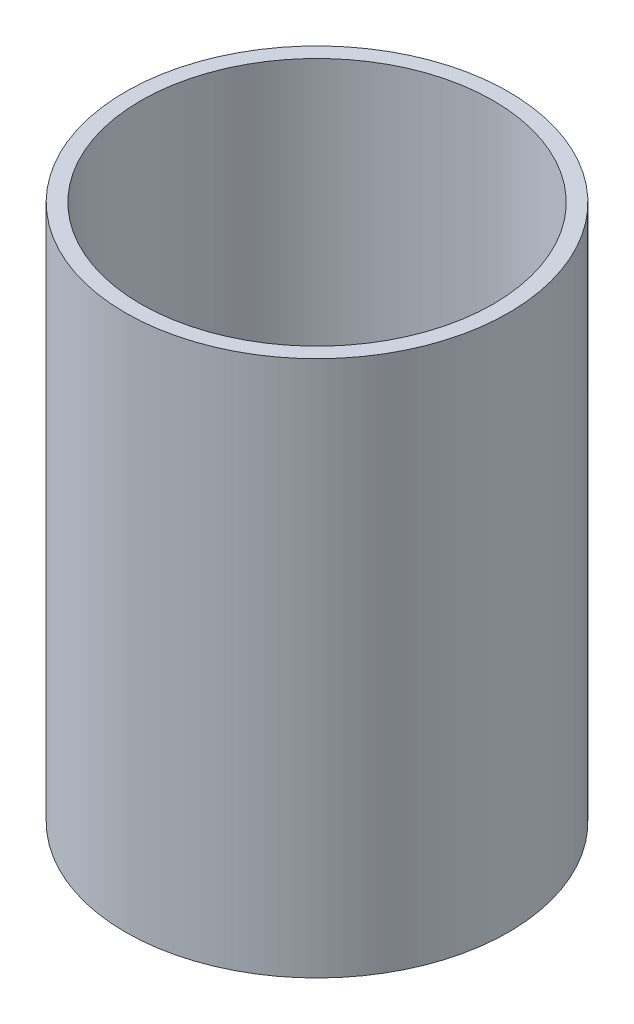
ISO-10303-21;
HEADER;
FILE_DESCRIPTION(('STEP AP214'),'2;1');
FILE_NAME('part.step','',(''),(''),'','','');
FILE_SCHEMA(('AUTOMOTIVE_DESIGN { 1 0 10303 214 1 1 1 1 }'));
ENDSEC;
DATA;
#1=APPLICATION_CONTEXT('core data for automotive mechanical design processes');
#2=APPLICATION_PROTOCOL_DEFINITION('international standard','automotive_design',2000,#1);
#3=PRODUCT_CONTEXT('',#1,'mechanical');
#4=PRODUCT('Part','Part','',(#3));
#5=PRODUCT_RELATED_PRODUCT_CATEGORY('part','',(#4));
#6=PRODUCT_DEFINITION_FORMATION('','',#4);
#7=PRODUCT_DEFINITION_CONTEXT('part definition',#1,'design');
#8=PRODUCT_DEFINITION('design','',#6,#7);
#9=PRODUCT_DEFINITION_SHAPE('','',#8);
#10=(LENGTH_UNIT() NAMED_UNIT(*) SI_UNIT(.MILLI.,.METRE.));
#11=(NAMED_UNIT(*) PLANE_ANGLE_UNIT() SI_UNIT($,.RADIAN.));
#12=(NAMED_UNIT(*) SI_UNIT($,.STERADIAN.) SOLID_ANGLE_UNIT());
#13=UNCERTAINTY_MEASURE_WITH_UNIT(LENGTH_MEASURE(1.E-05),#10,'distance_accuracy_value','');
#14=(GEOMETRIC_REPRESENTATION_CONTEXT(3) GLOBAL_UNCERTAINTY_ASSIGNED_CONTEXT((#13)) GLOBAL_UNIT_ASSIGNED_CONTEXT((#10,
#11,#12)) REPRESENTATION_CONTEXT('',''));
#15=CARTESIAN_POINT('',(0.,0.,0.));
#16=DIRECTION('',(0.,0.,1.));
#17=DIRECTION('',(1.,0.,0.));
#18=AXIS2_PLACEMENT_3D('',#15,#16,#17);
#19=CARTESIAN_POINT('',(0.,35.,0.));
#20=DIRECTION('',(0.,1.,0.));
#21=DIRECTION('',(0.,0.,1.));
#22=AXIS2_PLACEMENT_3D('',#19,#20,#21);
#23=PLANE('',#22);
#24=CARTESIAN_POINT('',(0.,35.,0.));
#25=DIRECTION('',(0.,1.,0.));
#26=DIRECTION('',(0.,0.,1.));
#27=AXIS2_PLACEMENT_3D('',#24,#25,#26);
#28=CIRCLE('',#27,12.5);
#29=CARTESIAN_POINT('',(0.,35.,12.5));
#30=VERTEX_POINT('',#29);
#31=EDGE_CURVE('E10',#30,#30,#28,.T.);
#32=ORIENTED_EDGE('',*,*,#31,.T.);
#33=EDGE_LOOP('',(#32));
#34=FACE_BOUND('',#33,.T.);
#35=CARTESIAN_POINT('',(0.,35.,0.));
#36=DIRECTION('',(0.,1.,0.));
#37=DIRECTION('',(0.,0.,1.));
#38=AXIS2_PLACEMENT_3D('',#35,#36,#37);
#39=CIRCLE('',#38,11.5);
#40=CARTESIAN_POINT('',(0.,35.,11.5));
#41=VERTEX_POINT('',#40);
#42=EDGE_CURVE('E40',#41,#41,#39,.T.);
#43=ORIENTED_EDGE('',*,*,#42,.F.);
#44=EDGE_LOOP('',(#43));
#45=FACE_BOUND('',#44,.T.);
#46=ADVANCED_FACE('F29',(#34,#45),#23,.T.);
#47=CARTESIAN_POINT('',(0.,0.,0.));
#48=DIRECTION('',(0.,1.,0.));
#49=DIRECTION('',(0.,0.,1.));
#50=AXIS2_PLACEMENT_3D('',#47,#48,#49);
#51=PLANE('',#50);
#52=CARTESIAN_POINT('',(0.,0.,0.));
#53=DIRECTION('',(0.,1.,0.));
#54=DIRECTION('',(0.,0.,1.));
#55=AXIS2_PLACEMENT_3D('',#52,#53,#54);
#56=CIRCLE('',#55,12.5);
#57=CARTESIAN_POINT('',(0.,0.,12.5));
#58=VERTEX_POINT('',#57);
#59=EDGE_CURVE('E33',#58,#58,#56,.T.);
#60=ORIENTED_EDGE('',*,*,#59,.F.);
#61=EDGE_LOOP('',(#60));
#62=FACE_BOUND('',#61,.T.);
#63=CARTESIAN_POINT('',(0.,0.,0.));
#64=DIRECTION('',(0.,1.,0.));
#65=DIRECTION('',(0.,0.,1.));
#66=AXIS2_PLACEMENT_3D('',#63,#64,#65);
#67=CIRCLE('',#66,11.5);
#68=CARTESIAN_POINT('',(0.,0.,11.5));
#69=VERTEX_POINT('',#68);
#70=EDGE_CURVE('E42',#69,#69,#67,.T.);
#71=ORIENTED_EDGE('',*,*,#70,.T.);
#72=EDGE_LOOP('',(#71));
#73=FACE_BOUND('',#72,.T.);
#74=ADVANCED_FACE('F52',(#62,#73),#51,.F.);
#75=CARTESIAN_POINT('',(0.,35.,0.));
#76=DIRECTION('',(0.,-1.,0.));
#77=DIRECTION('',(0.,0.,-1.));
#78=AXIS2_PLACEMENT_3D('',#75,#76,#77);
#79=CYLINDRICAL_SURFACE('',#78,12.5);
#80=ORIENTED_EDGE('',*,*,#31,.F.);
#81=EDGE_LOOP('',(#80));
#82=FACE_BOUND('',#81,.T.);
#83=ORIENTED_EDGE('',*,*,#59,.T.);
#84=EDGE_LOOP('',(#83));
#85=FACE_BOUND('',#84,.T.);
#86=ADVANCED_FACE('F31',(#82,#85),#79,.T.);
#87=CARTESIAN_POINT('',(0.,35.,0.));
#88=DIRECTION('',(0.,-1.,0.));
#89=DIRECTION('',(0.,0.,-1.));
#90=AXIS2_PLACEMENT_3D('',#87,#88,#89);
#91=CYLINDRICAL_SURFACE('',#90,11.5);
#92=ORIENTED_EDGE('',*,*,#42,.T.);
#93=EDGE_LOOP('',(#92));
#94=FACE_BOUND('',#93,.T.);
#95=ORIENTED_EDGE('',*,*,#70,.F.);
#96=EDGE_LOOP('',(#95));
#97=FACE_BOUND('',#96,.T.);
#98=ADVANCED_FACE('F48',(#94,#97),#91,.F.);
#99=CLOSED_SHELL('',(#46,#74,#86,#98));
#100=MANIFOLD_SOLID_BREP('B2',#99);
#101=ADVANCED_BREP_SHAPE_REPRESENTATION('',(#18,#100),#14);
#102=SHAPE_DEFINITION_REPRESENTATION(#9,#101);
ENDSEC;
END-ISO-10303-21;
